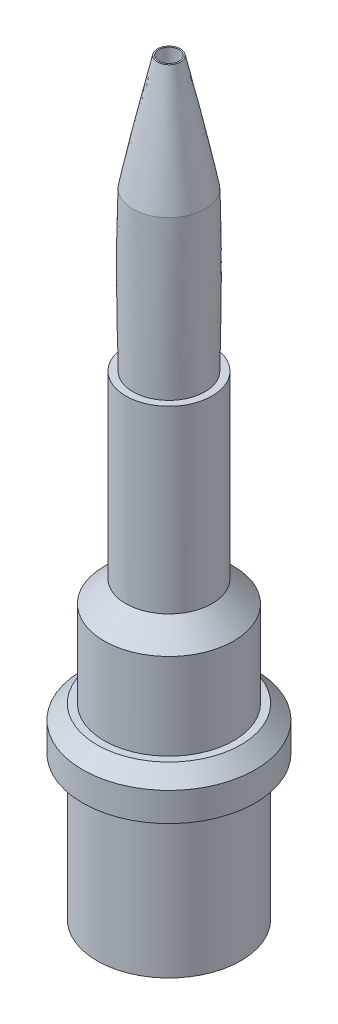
ISO-10303-21;
HEADER;
FILE_DESCRIPTION(('STEP AP214'),'2;1');
FILE_NAME('part.step','',(''),(''),'','','');
FILE_SCHEMA(('AUTOMOTIVE_DESIGN { 1 0 10303 214 1 1 1 1 }'));
ENDSEC;
DATA;
#1=APPLICATION_CONTEXT('core data for automotive mechanical design processes');
#2=APPLICATION_PROTOCOL_DEFINITION('international standard','automotive_design',2000,#1);
#3=PRODUCT_CONTEXT('',#1,'mechanical');
#4=PRODUCT('Part','Part','',(#3));
#5=PRODUCT_RELATED_PRODUCT_CATEGORY('part','',(#4));
#6=PRODUCT_DEFINITION_FORMATION('','',#4);
#7=PRODUCT_DEFINITION_CONTEXT('part definition',#1,'design');
#8=PRODUCT_DEFINITION('design','',#6,#7);
#9=PRODUCT_DEFINITION_SHAPE('','',#8);
#10=(LENGTH_UNIT() NAMED_UNIT(*) SI_UNIT(.MILLI.,.METRE.));
#11=(NAMED_UNIT(*) PLANE_ANGLE_UNIT() SI_UNIT($,.RADIAN.));
#12=(NAMED_UNIT(*) SI_UNIT($,.STERADIAN.) SOLID_ANGLE_UNIT());
#13=UNCERTAINTY_MEASURE_WITH_UNIT(LENGTH_MEASURE(1.E-05),#10,'distance_accuracy_value','');
#14=(GEOMETRIC_REPRESENTATION_CONTEXT(3) GLOBAL_UNCERTAINTY_ASSIGNED_CONTEXT((#13)) GLOBAL_UNIT_ASSIGNED_CONTEXT((#10,
#11,#12)) REPRESENTATION_CONTEXT('',''));
#15=CARTESIAN_POINT('',(0.,0.,0.));
#16=DIRECTION('',(0.,0.,1.));
#17=DIRECTION('',(1.,0.,0.));
#18=AXIS2_PLACEMENT_3D('',#15,#16,#17);
#19=CARTESIAN_POINT('',(0.,26.,0.));
#20=DIRECTION('',(0.,1.,0.));
#21=DIRECTION('',(0.,0.,1.));
#22=AXIS2_PLACEMENT_3D('',#19,#20,#21);
#23=PLANE('',#22);
#24=CARTESIAN_POINT('',(0.,26.,0.));
#25=DIRECTION('',(0.,1.,0.));
#26=DIRECTION('',(0.,0.,1.));
#27=AXIS2_PLACEMENT_3D('',#24,#25,#26);
#28=CIRCLE('',#27,0.35);
#29=CARTESIAN_POINT('',(0.,26.,0.35));
#30=VERTEX_POINT('',#29);
#31=EDGE_CURVE('E199',#30,#30,#28,.T.);
#32=ORIENTED_EDGE('',*,*,#31,.F.);
#33=EDGE_LOOP('',(#32));
#34=FACE_BOUND('',#33,.T.);
#35=CARTESIAN_POINT('',(0.,26.,0.));
#36=DIRECTION('',(0.,1.,0.));
#37=DIRECTION('',(0.,0.,1.));
#38=AXIS2_PLACEMENT_3D('',#35,#36,#37);
#39=CIRCLE('',#38,0.4);
#40=CARTESIAN_POINT('',(0.,26.,0.4));
#41=VERTEX_POINT('',#40);
#42=EDGE_CURVE('E175',#41,#41,#39,.T.);
#43=ORIENTED_EDGE('',*,*,#42,.T.);
#44=EDGE_LOOP('',(#43));
#45=FACE_BOUND('',#44,.T.);
#46=ADVANCED_FACE('F161',(#34,#45),#23,.T.);
#47=CARTESIAN_POINT('',(0.,16.5,0.));
#48=DIRECTION('',(0.,1.,0.));
#49=DIRECTION('',(0.,0.,1.));
#50=AXIS2_PLACEMENT_3D('',#47,#48,#49);
#51=PLANE('',#50);
#52=CARTESIAN_POINT('',(0.,16.5,0.));
#53=DIRECTION('',(0.,1.,0.));
#54=DIRECTION('',(0.,0.,1.));
#55=AXIS2_PLACEMENT_3D('',#52,#53,#54);
#56=CIRCLE('',#55,0.35);
#57=CARTESIAN_POINT('',(0.,16.5,0.35));
#58=VERTEX_POINT('',#57);
#59=EDGE_CURVE('E165',#58,#58,#56,.T.);
#60=ORIENTED_EDGE('',*,*,#59,.T.);
#61=EDGE_LOOP('',(#60));
#62=FACE_BOUND('',#61,.T.);
#63=CARTESIAN_POINT('',(0.,16.5,0.));
#64=DIRECTION('',(0.,1.,0.));
#65=DIRECTION('',(0.,0.,1.));
#66=AXIS2_PLACEMENT_3D('',#63,#64,#65);
#67=CIRCLE('',#66,1.25);
#68=CARTESIAN_POINT('',(0.,16.5,1.25));
#69=VERTEX_POINT('',#68);
#70=EDGE_CURVE('E13',#69,#69,#67,.T.);
#71=ORIENTED_EDGE('',*,*,#70,.F.);
#72=EDGE_LOOP('',(#71));
#73=FACE_BOUND('',#72,.T.);
#74=ADVANCED_FACE('F230',(#62,#73),#51,.F.);
#75=CARTESIAN_POINT('',(-1.25,22.,0.));
#76=CARTESIAN_POINT('',(-0.966666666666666,23.3333333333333,0.));
#77=CARTESIAN_POINT('',(-0.683333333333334,24.6666666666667,0.));
#78=CARTESIAN_POINT('',(-0.4,26.,0.));
#79=CARTESIAN_POINT('',(-1.25,22.,0.163624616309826));
#80=CARTESIAN_POINT('',(-0.966666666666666,23.3333333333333,0.142352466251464));
#81=CARTESIAN_POINT('',(-0.683333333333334,24.6666666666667,0.0973561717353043));
#82=CARTESIAN_POINT('',(-0.4,26.,0.0523598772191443));
#83=CARTESIAN_POINT('',(-1.18498884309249,22.,0.490813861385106));
#84=CARTESIAN_POINT('',(-0.92521149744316,23.3333333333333,0.411903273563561));
#85=CARTESIAN_POINT('',(-0.652206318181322,24.6666666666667,0.284485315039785));
#86=CARTESIAN_POINT('',(-0.379201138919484,26.,0.15706735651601));
#87=CARTESIAN_POINT('',(-0.906916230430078,22.,0.906916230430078));
#88=CARTESIAN_POINT('',(-0.72859268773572,23.3333333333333,0.728603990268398));
#89=CARTESIAN_POINT('',(-0.509386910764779,24.6666666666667,0.509422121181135));
#90=CARTESIAN_POINT('',(-0.290181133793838,26.,0.290240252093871));
#91=CARTESIAN_POINT('',(-0.490813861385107,22.,1.18498884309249));
#92=CARTESIAN_POINT('',(-0.41190567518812,23.3333333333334,0.925207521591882));
#93=CARTESIAN_POINT('',(-0.284492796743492,24.6666666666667,0.652193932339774));
#94=CARTESIAN_POINT('',(-0.157079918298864,26.,0.379180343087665));
#95=CARTESIAN_POINT('',(-0.163624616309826,22.,1.25));
#96=CARTESIAN_POINT('',(-0.142352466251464,23.3333333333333,0.966666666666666));
#97=CARTESIAN_POINT('',(-0.0973561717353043,24.6666666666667,0.683333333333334));
#98=CARTESIAN_POINT('',(-0.0523598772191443,26.,0.4));
#99=CARTESIAN_POINT('',(0.163624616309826,22.,1.25));
#100=CARTESIAN_POINT('',(0.142352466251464,23.3333333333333,0.966666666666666));
#101=CARTESIAN_POINT('',(0.0973561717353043,24.6666666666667,0.683333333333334));
#102=CARTESIAN_POINT('',(0.0523598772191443,26.,0.4));
#103=CARTESIAN_POINT('',(0.490813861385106,22.,1.18498884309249));
#104=CARTESIAN_POINT('',(0.411903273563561,23.3333333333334,0.92521149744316));
#105=CARTESIAN_POINT('',(0.284485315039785,24.6666666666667,0.652206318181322));
#106=CARTESIAN_POINT('',(0.15706735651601,26.,0.379201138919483));
#107=CARTESIAN_POINT('',(0.906916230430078,22.,0.906916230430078));
#108=CARTESIAN_POINT('',(0.728603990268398,23.3333333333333,0.72859268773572));
#109=CARTESIAN_POINT('',(0.509422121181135,24.6666666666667,0.509386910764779));
#110=CARTESIAN_POINT('',(0.290240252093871,26.,0.290181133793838));
#111=CARTESIAN_POINT('',(1.18498884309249,22.,0.490813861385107));
#112=CARTESIAN_POINT('',(0.925207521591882,23.3333333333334,0.41190567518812));
#113=CARTESIAN_POINT('',(0.652193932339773,24.6666666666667,0.284492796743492));
#114=CARTESIAN_POINT('',(0.379180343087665,26.,0.157079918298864));
#115=CARTESIAN_POINT('',(1.25,22.,0.163624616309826));
#116=CARTESIAN_POINT('',(0.966666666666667,23.3333333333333,0.142352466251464));
#117=CARTESIAN_POINT('',(0.683333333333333,24.6666666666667,0.0973561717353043));
#118=CARTESIAN_POINT('',(0.4,26.,0.0523598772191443));
#119=CARTESIAN_POINT('',(1.25,22.,-0.163624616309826));
#120=CARTESIAN_POINT('',(0.966666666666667,23.3333333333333,-0.142352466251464));
#121=CARTESIAN_POINT('',(0.683333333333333,24.6666666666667,-0.0973561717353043));
#122=CARTESIAN_POINT('',(0.4,26.,-0.0523598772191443));
#123=CARTESIAN_POINT('',(1.18498884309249,22.,-0.490813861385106));
#124=CARTESIAN_POINT('',(0.92521149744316,23.3333333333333,-0.411903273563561));
#125=CARTESIAN_POINT('',(0.652206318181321,24.6666666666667,-0.284485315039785));
#126=CARTESIAN_POINT('',(0.379201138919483,26.,-0.15706735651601));
#127=CARTESIAN_POINT('',(0.906916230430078,22.,-0.906916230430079));
#128=CARTESIAN_POINT('',(0.72859268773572,23.3333333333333,-0.728603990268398));
#129=CARTESIAN_POINT('',(0.509386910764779,24.6666666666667,-0.509422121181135));
#130=CARTESIAN_POINT('',(0.290181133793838,26.,-0.290240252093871));
#131=CARTESIAN_POINT('',(0.490813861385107,22.,-1.18498884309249));
#132=CARTESIAN_POINT('',(0.41190567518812,23.3333333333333,-0.925207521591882));
#133=CARTESIAN_POINT('',(0.284492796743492,24.6666666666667,-0.652193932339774));
#134=CARTESIAN_POINT('',(0.157079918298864,26.,-0.379180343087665));
#135=CARTESIAN_POINT('',(0.163624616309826,22.,-1.25));
#136=CARTESIAN_POINT('',(0.142352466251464,23.3333333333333,-0.966666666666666));
#137=CARTESIAN_POINT('',(0.0973561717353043,24.6666666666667,-0.683333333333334));
#138=CARTESIAN_POINT('',(0.0523598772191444,26.,-0.4));
#139=CARTESIAN_POINT('',(-0.163624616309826,22.,-1.25));
#140=CARTESIAN_POINT('',(-0.142352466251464,23.3333333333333,-0.966666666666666));
#141=CARTESIAN_POINT('',(-0.0973561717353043,24.6666666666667,-0.683333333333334));
#142=CARTESIAN_POINT('',(-0.0523598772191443,26.,-0.4));
#143=CARTESIAN_POINT('',(-0.490813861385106,22.,-1.18498884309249));
#144=CARTESIAN_POINT('',(-0.411903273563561,23.3333333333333,-0.92521149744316));
#145=CARTESIAN_POINT('',(-0.284485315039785,24.6666666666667,-0.652206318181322));
#146=CARTESIAN_POINT('',(-0.15706735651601,26.,-0.379201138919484));
#147=CARTESIAN_POINT('',(-0.906916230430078,22.,-0.906916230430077));
#148=CARTESIAN_POINT('',(-0.728603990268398,23.3333333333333,-0.728592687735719));
#149=CARTESIAN_POINT('',(-0.509422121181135,24.6666666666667,-0.509386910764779));
#150=CARTESIAN_POINT('',(-0.290240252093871,26.,-0.290181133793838));
#151=CARTESIAN_POINT('',(-1.18498884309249,22.,-0.490813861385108));
#152=CARTESIAN_POINT('',(-0.925207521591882,23.3333333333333,-0.411905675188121));
#153=CARTESIAN_POINT('',(-0.652193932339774,24.6666666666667,-0.284492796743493));
#154=CARTESIAN_POINT('',(-0.379180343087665,26.,-0.157079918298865));
#155=CARTESIAN_POINT('',(-1.25,22.,-0.163624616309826));
#156=CARTESIAN_POINT('',(-0.966666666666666,23.3333333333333,-0.142352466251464));
#157=CARTESIAN_POINT('',(-0.683333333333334,24.6666666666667,-0.0973561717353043));
#158=CARTESIAN_POINT('',(-0.4,26.,-0.0523598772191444));
#159=CARTESIAN_POINT('',(-1.25,22.,0.));
#160=CARTESIAN_POINT('',(-0.966666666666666,23.3333333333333,0.));
#161=CARTESIAN_POINT('',(-0.683333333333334,24.6666666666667,0.));
#162=CARTESIAN_POINT('',(-0.4,26.,0.));
#163=B_SPLINE_SURFACE_WITH_KNOTS('',3,3,((#75,#76,#77,#78),(#79,#80,#81,#82),(#83,#84,#85,#86),
(#87,#88,#89,#90),(#91,#92,#93,#94),(#95,#96,#97,#98),(#99,#100,#101,#102),(#103,#104,#105,
#106),(#107,#108,#109,#110),(#111,#112,#113,#114),(#115,#116,#117,#118),(#119,#120,#121,#122),
(#123,#124,#125,#126),(#127,#128,#129,#130),(#131,#132,#133,#134),(#135,#136,#137,#138),(#139,
#140,#141,#142),(#143,#144,#145,#146),(#147,#148,#149,#150),(#151,#152,#153,#154),(#155,#156,
#157,#158),(#159,#160,#161,#162)),.UNSPECIFIED.,.T.,.F.,.F.,(4,1,1,1,2,1,1,1,2,1,1,1,2,1,1,1,4),
(4,4),(0.,0.0625,0.125,0.1875,0.25,0.3125,0.375,0.4375,0.5,0.5625,0.625,0.6875,0.75,0.8125,
0.875,0.9375,1.),(0.57355502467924,1.),.UNSPECIFIED.);
#164=CARTESIAN_POINT('',(-1.25,22.,0.));
#165=CARTESIAN_POINT('',(-1.25,22.,0.163624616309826));
#166=CARTESIAN_POINT('',(-1.18498884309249,22.,0.490813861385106));
#167=CARTESIAN_POINT('',(-0.906916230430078,22.,0.906916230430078));
#168=CARTESIAN_POINT('',(-0.490813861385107,22.,1.18498884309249));
#169=CARTESIAN_POINT('',(-0.163624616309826,22.,1.25));
#170=CARTESIAN_POINT('',(0.163624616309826,22.,1.25));
#171=CARTESIAN_POINT('',(0.490813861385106,22.,1.18498884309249));
#172=CARTESIAN_POINT('',(0.906916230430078,22.,0.906916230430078));
#173=CARTESIAN_POINT('',(1.18498884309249,22.,0.490813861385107));
#174=CARTESIAN_POINT('',(1.25,22.,0.163624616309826));
#175=CARTESIAN_POINT('',(1.25,22.,-0.163624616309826));
#176=CARTESIAN_POINT('',(1.18498884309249,22.,-0.490813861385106));
#177=CARTESIAN_POINT('',(0.906916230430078,22.,-0.906916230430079));
#178=CARTESIAN_POINT('',(0.490813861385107,22.,-1.18498884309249));
#179=CARTESIAN_POINT('',(0.163624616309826,22.,-1.25));
#180=CARTESIAN_POINT('',(-0.163624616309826,22.,-1.25));
#181=CARTESIAN_POINT('',(-0.490813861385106,22.,-1.18498884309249));
#182=CARTESIAN_POINT('',(-0.906916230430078,22.,-0.906916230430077));
#183=CARTESIAN_POINT('',(-1.18498884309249,22.,-0.490813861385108));
#184=CARTESIAN_POINT('',(-1.25,22.,-0.163624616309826));
#185=CARTESIAN_POINT('',(-1.25,22.,0.));
#186=B_SPLINE_CURVE_WITH_KNOTS('',3,(#164,#165,#166,#167,#168,#169,#170,#171,#172,#173,#174,
#175,#176,#177,#178,#179,#180,#181,#182,#183,#184,#185),.UNSPECIFIED.,.T.,.F.,(4,1,1,1,2,1,1,1,
2,1,1,1,2,1,1,1,4),(0.,0.0625,0.125,0.1875,0.25,0.3125,0.375,0.4375,0.5,0.5625,0.625,0.6875,
0.75,0.8125,0.875,0.9375,1.),.UNSPECIFIED.);
#187=CARTESIAN_POINT('',(-1.25,22.,0.));
#188=VERTEX_POINT('',#187);
#189=EDGE_CURVE('E169',#188,#188,#186,.T.);
#190=ORIENTED_EDGE('',*,*,#42,.F.);
#191=EDGE_LOOP('',(#190));
#192=FACE_BOUND('',#191,.T.);
#193=ORIENTED_EDGE('',*,*,#189,.T.);
#194=EDGE_LOOP('',(#193));
#195=FACE_BOUND('',#194,.T.);
#196=ADVANCED_FACE('F228',(#192,#195),#163,.T.);
#197=CARTESIAN_POINT('',(-1.25,16.5,0.));
#198=CARTESIAN_POINT('',(-1.25,18.3333333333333,0.));
#199=CARTESIAN_POINT('',(-1.25,20.1666666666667,0.));
#200=CARTESIAN_POINT('',(-1.25,22.,0.));
#201=CARTESIAN_POINT('',(-1.25,16.5,0.163624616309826));
#202=CARTESIAN_POINT('',(-1.25,18.3333333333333,0.177929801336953));
#203=CARTESIAN_POINT('',(-1.25,20.1666666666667,0.19223498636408));
#204=CARTESIAN_POINT('',(-1.25,22.,0.163624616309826));
#205=CARTESIAN_POINT('',(-1.18498884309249,16.5,0.490813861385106));
#206=CARTESIAN_POINT('',(-1.19296496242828,18.3333333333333,0.520062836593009));
#207=CARTESIAN_POINT('',(-1.20094108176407,20.1666666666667,0.549311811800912));
#208=CARTESIAN_POINT('',(-1.18498884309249,22.,0.490813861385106));
#209=CARTESIAN_POINT('',(-0.906916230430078,16.5,0.906916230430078));
#210=CARTESIAN_POINT('',(-0.931567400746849,18.3333333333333,0.93155979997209));
#211=CARTESIAN_POINT('',(-0.95621857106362,20.1666666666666,0.956203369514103));
#212=CARTESIAN_POINT('',(-0.906916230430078,22.,0.906916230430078));
#213=CARTESIAN_POINT('',(-0.490813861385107,16.5,1.18498884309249));
#214=CARTESIAN_POINT('',(-0.520061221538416,18.3333333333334,1.19296763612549));
#215=CARTESIAN_POINT('',(-0.549308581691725,20.1666666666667,1.20094642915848));
#216=CARTESIAN_POINT('',(-0.490813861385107,22.,1.18498884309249));
#217=CARTESIAN_POINT('',(-0.163624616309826,16.5,1.25));
#218=CARTESIAN_POINT('',(-0.177929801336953,18.3333333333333,1.25));
#219=CARTESIAN_POINT('',(-0.19223498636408,20.1666666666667,1.25));
#220=CARTESIAN_POINT('',(-0.163624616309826,22.,1.25));
#221=CARTESIAN_POINT('',(0.163624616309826,16.5,1.25));
#222=CARTESIAN_POINT('',(0.177929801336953,18.3333333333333,1.25));
#223=CARTESIAN_POINT('',(0.19223498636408,20.1666666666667,1.25));
#224=CARTESIAN_POINT('',(0.163624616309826,22.,1.25));
#225=CARTESIAN_POINT('',(0.490813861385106,16.5,1.18498884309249));
#226=CARTESIAN_POINT('',(0.520062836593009,18.3333333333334,1.19296496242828));
#227=CARTESIAN_POINT('',(0.549311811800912,20.1666666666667,1.20094108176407));
#228=CARTESIAN_POINT('',(0.490813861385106,22.,1.18498884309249));
#229=CARTESIAN_POINT('',(0.906916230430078,16.5,0.906916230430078));
#230=CARTESIAN_POINT('',(0.93155979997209,18.3333333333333,0.931567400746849));
#231=CARTESIAN_POINT('',(0.956203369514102,20.1666666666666,0.95621857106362));
#232=CARTESIAN_POINT('',(0.906916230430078,22.,0.906916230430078));
#233=CARTESIAN_POINT('',(1.18498884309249,16.5,0.490813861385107));
#234=CARTESIAN_POINT('',(1.19296763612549,18.3333333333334,0.520061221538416));
#235=CARTESIAN_POINT('',(1.20094642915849,20.1666666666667,0.549308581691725));
#236=CARTESIAN_POINT('',(1.18498884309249,22.,0.490813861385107));
#237=CARTESIAN_POINT('',(1.25,16.5,0.163624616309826));
#238=CARTESIAN_POINT('',(1.25,18.3333333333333,0.177929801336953));
#239=CARTESIAN_POINT('',(1.25,20.1666666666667,0.19223498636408));
#240=CARTESIAN_POINT('',(1.25,22.,0.163624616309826));
#241=CARTESIAN_POINT('',(1.25,16.5,-0.163624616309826));
#242=CARTESIAN_POINT('',(1.25,18.3333333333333,-0.177929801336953));
#243=CARTESIAN_POINT('',(1.25,20.1666666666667,-0.19223498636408));
#244=CARTESIAN_POINT('',(1.25,22.,-0.163624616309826));
#245=CARTESIAN_POINT('',(1.18498884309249,16.5,-0.490813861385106));
#246=CARTESIAN_POINT('',(1.19296496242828,18.3333333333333,-0.520062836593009));
#247=CARTESIAN_POINT('',(1.20094108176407,20.1666666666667,-0.549311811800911));
#248=CARTESIAN_POINT('',(1.18498884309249,22.,-0.490813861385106));
#249=CARTESIAN_POINT('',(0.906916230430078,16.5,-0.906916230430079));
#250=CARTESIAN_POINT('',(0.93156740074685,18.3333333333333,-0.931559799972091));
#251=CARTESIAN_POINT('',(0.956218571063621,20.1666666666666,-0.956203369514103));
#252=CARTESIAN_POINT('',(0.906916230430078,22.,-0.906916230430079));
#253=CARTESIAN_POINT('',(0.490813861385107,16.5,-1.18498884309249));
#254=CARTESIAN_POINT('',(0.520061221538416,18.3333333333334,-1.19296763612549));
#255=CARTESIAN_POINT('',(0.549308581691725,20.1666666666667,-1.20094642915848));
#256=CARTESIAN_POINT('',(0.490813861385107,22.,-1.18498884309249));
#257=CARTESIAN_POINT('',(0.163624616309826,16.5,-1.25));
#258=CARTESIAN_POINT('',(0.177929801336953,18.3333333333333,-1.25));
#259=CARTESIAN_POINT('',(0.19223498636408,20.1666666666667,-1.25));
#260=CARTESIAN_POINT('',(0.163624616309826,22.,-1.25));
#261=CARTESIAN_POINT('',(-0.163624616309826,16.5,-1.25));
#262=CARTESIAN_POINT('',(-0.177929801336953,18.3333333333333,-1.25));
#263=CARTESIAN_POINT('',(-0.19223498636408,20.1666666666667,-1.25));
#264=CARTESIAN_POINT('',(-0.163624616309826,22.,-1.25));
#265=CARTESIAN_POINT('',(-0.490813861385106,16.5,-1.18498884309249));
#266=CARTESIAN_POINT('',(-0.520062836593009,18.3333333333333,-1.19296496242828));
#267=CARTESIAN_POINT('',(-0.549311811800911,20.1666666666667,-1.20094108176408));
#268=CARTESIAN_POINT('',(-0.490813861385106,22.,-1.18498884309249));
#269=CARTESIAN_POINT('',(-0.906916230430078,16.5,-0.906916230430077));
#270=CARTESIAN_POINT('',(-0.93155979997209,18.3333333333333,-0.931567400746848));
#271=CARTESIAN_POINT('',(-0.956203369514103,20.1666666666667,-0.956218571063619));
#272=CARTESIAN_POINT('',(-0.906916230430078,22.,-0.906916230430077));
#273=CARTESIAN_POINT('',(-1.18498884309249,16.5,-0.490813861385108));
#274=CARTESIAN_POINT('',(-1.19296763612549,18.3333333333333,-0.520061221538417));
#275=CARTESIAN_POINT('',(-1.20094642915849,20.1666666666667,-0.549308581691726));
#276=CARTESIAN_POINT('',(-1.18498884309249,22.,-0.490813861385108));
#277=CARTESIAN_POINT('',(-1.25,16.5,-0.163624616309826));
#278=CARTESIAN_POINT('',(-1.25,18.3333333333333,-0.177929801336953));
#279=CARTESIAN_POINT('',(-1.25,20.1666666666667,-0.19223498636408));
#280=CARTESIAN_POINT('',(-1.25,22.,-0.163624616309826));
#281=CARTESIAN_POINT('',(-1.25,16.5,0.));
#282=CARTESIAN_POINT('',(-1.25,18.3333333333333,0.));
#283=CARTESIAN_POINT('',(-1.25,20.1666666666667,0.));
#284=CARTESIAN_POINT('',(-1.25,22.,0.));
#285=B_SPLINE_SURFACE_WITH_KNOTS('',3,3,((#197,#198,#199,#200),(#201,#202,#203,#204),(#205,#206,
#207,#208),(#209,#210,#211,#212),(#213,#214,#215,#216),(#217,#218,#219,#220),(#221,#222,#223,
#224),(#225,#226,#227,#228),(#229,#230,#231,#232),(#233,#234,#235,#236),(#237,#238,#239,#240),
(#241,#242,#243,#244),(#245,#246,#247,#248),(#249,#250,#251,#252),(#253,#254,#255,#256),(#257,
#258,#259,#260),(#261,#262,#263,#264),(#265,#266,#267,#268),(#269,#270,#271,#272),(#273,#274,
#275,#276),(#277,#278,#279,#280),(#281,#282,#283,#284)),.UNSPECIFIED.,.T.,.F.,.F.,(4,1,1,1,2,1,
1,1,2,1,1,1,2,1,1,1,4),(4,4),(0.,0.0625,0.125,0.1875,0.25,0.3125,0.375,0.4375,0.5,0.5625,0.625,
0.6875,0.75,0.8125,0.875,0.9375,1.),(0.,0.57355502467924),.UNSPECIFIED.);
#286=ORIENTED_EDGE('',*,*,#189,.F.);
#287=EDGE_LOOP('',(#286));
#288=FACE_BOUND('',#287,.T.);
#289=ORIENTED_EDGE('',*,*,#70,.T.);
#290=EDGE_LOOP('',(#289));
#291=FACE_BOUND('',#290,.T.);
#292=ADVANCED_FACE('F217',(#288,#291),#285,.T.);
#293=CARTESIAN_POINT('',(0.,0.,0.));
#294=DIRECTION('',(0.,1.,0.));
#295=DIRECTION('',(0.,0.,1.));
#296=AXIS2_PLACEMENT_3D('',#293,#294,#295);
#297=CYLINDRICAL_SURFACE('',#296,0.35);
#298=ORIENTED_EDGE('',*,*,#31,.T.);
#299=EDGE_LOOP('',(#298));
#300=FACE_BOUND('',#299,.T.);
#301=ORIENTED_EDGE('',*,*,#59,.F.);
#302=EDGE_LOOP('',(#301));
#303=FACE_BOUND('',#302,.T.);
#304=ADVANCED_FACE('F227',(#300,#303),#297,.F.);
#305=CLOSED_SHELL('',(#46,#74,#196,#292,#304));
#306=MANIFOLD_SOLID_BREP('B2',#305);
#307=CARTESIAN_POINT('',(0.,6.5,0.));
#308=DIRECTION('',(0.,1.,0.));
#309=DIRECTION('',(0.,0.,1.));
#310=AXIS2_PLACEMENT_3D('',#307,#308,#309);
#311=PLANE('',#310);
#312=CARTESIAN_POINT('',(0.,6.5,0.));
#313=DIRECTION('',(0.,1.,0.));
#314=DIRECTION('',(0.,0.,1.));
#315=AXIS2_PLACEMENT_3D('',#312,#313,#314);
#316=CIRCLE('',#315,2.5);
#317=CARTESIAN_POINT('',(0.,6.5,2.5));
#318=VERTEX_POINT('',#317);
#319=EDGE_CURVE('E308',#318,#318,#316,.T.);
#320=ORIENTED_EDGE('',*,*,#319,.T.);
#321=EDGE_LOOP('',(#320));
#322=FACE_BOUND('',#321,.T.);
#323=CARTESIAN_POINT('',(0.,6.5,0.));
#324=DIRECTION('',(0.,1.,0.));
#325=DIRECTION('',(0.,0.,1.));
#326=AXIS2_PLACEMENT_3D('',#323,#324,#325);
#327=CIRCLE('',#326,2.25);
#328=CARTESIAN_POINT('',(0.,6.5,2.25));
#329=VERTEX_POINT('',#328);
#330=EDGE_CURVE('E335',#329,#329,#327,.T.);
#331=ORIENTED_EDGE('',*,*,#330,.F.);
#332=EDGE_LOOP('',(#331));
#333=FACE_BOUND('',#332,.T.);
#334=ADVANCED_FACE('F301',(#322,#333),#311,.T.);
#335=CARTESIAN_POINT('',(0.,5.,0.));
#336=DIRECTION('',(0.,-1.,0.));
#337=DIRECTION('',(0.,0.,-1.));
#338=AXIS2_PLACEMENT_3D('',#335,#336,#337);
#339=CYLINDRICAL_SURFACE('',#338,2.5);
#340=CARTESIAN_POINT('',(0.,5.,0.));
#341=DIRECTION('',(0.,1.,0.));
#342=DIRECTION('',(0.,0.,1.));
#343=AXIS2_PLACEMENT_3D('',#340,#341,#342);
#344=CIRCLE('',#343,2.5);
#345=CARTESIAN_POINT('',(0.,5.,2.5));
#346=VERTEX_POINT('',#345);
#347=EDGE_CURVE('E321',#346,#346,#344,.T.);
#348=ORIENTED_EDGE('',*,*,#347,.F.);
#349=EDGE_LOOP('',(#348));
#350=FACE_BOUND('',#349,.T.);
#351=CARTESIAN_POINT('',(0.,0.,0.));
#352=DIRECTION('',(0.,1.,0.));
#353=DIRECTION('',(0.,0.,1.));
#354=AXIS2_PLACEMENT_3D('',#351,#352,#353);
#355=CIRCLE('',#354,2.5);
#356=CARTESIAN_POINT('',(0.,0.,2.5));
#357=VERTEX_POINT('',#356);
#358=EDGE_CURVE('E327',#357,#357,#355,.T.);
#359=ORIENTED_EDGE('',*,*,#358,.T.);
#360=EDGE_LOOP('',(#359));
#361=FACE_BOUND('',#360,.T.);
#362=ADVANCED_FACE('F361',(#350,#361),#339,.T.);
#363=CARTESIAN_POINT('',(0.,0.,0.));
#364=DIRECTION('',(0.,1.,0.));
#365=DIRECTION('',(0.,0.,1.));
#366=AXIS2_PLACEMENT_3D('',#363,#364,#365);
#367=PLANE('',#366);
#368=CARTESIAN_POINT('',(0.,0.,0.));
#369=DIRECTION('',(0.,1.,0.));
#370=DIRECTION('',(0.,0.,1.));
#371=AXIS2_PLACEMENT_3D('',#368,#369,#370);
#372=CIRCLE('',#371,0.35);
#373=CARTESIAN_POINT('',(0.,0.,0.35));
#374=VERTEX_POINT('',#373);
#375=EDGE_CURVE('E326',#374,#374,#372,.T.);
#376=ORIENTED_EDGE('',*,*,#375,.T.);
#377=EDGE_LOOP('',(#376));
#378=FACE_BOUND('',#377,.T.);
#379=ORIENTED_EDGE('',*,*,#358,.F.);
#380=EDGE_LOOP('',(#379));
#381=FACE_BOUND('',#380,.T.);
#382=ADVANCED_FACE('F343',(#378,#381),#367,.F.);
#383=CARTESIAN_POINT('',(0.,5.,0.));
#384=DIRECTION('',(0.,1.,0.));
#385=DIRECTION('',(0.,0.,1.));
#386=AXIS2_PLACEMENT_3D('',#383,#384,#385);
#387=PLANE('',#386);
#388=CARTESIAN_POINT('',(0.,5.,0.));
#389=DIRECTION('',(0.,1.,0.));
#390=DIRECTION('',(0.,0.,1.));
#391=AXIS2_PLACEMENT_3D('',#388,#389,#390);
#392=CIRCLE('',#391,3.);
#393=CARTESIAN_POINT('',(0.,5.,3.));
#394=VERTEX_POINT('',#393);
#395=EDGE_CURVE('E330',#394,#394,#392,.T.);
#396=ORIENTED_EDGE('',*,*,#395,.F.);
#397=EDGE_LOOP('',(#396));
#398=FACE_BOUND('',#397,.T.);
#399=ORIENTED_EDGE('',*,*,#347,.T.);
#400=EDGE_LOOP('',(#399));
#401=FACE_BOUND('',#400,.T.);
#402=ADVANCED_FACE('F373',(#398,#401),#387,.F.);
#403=CARTESIAN_POINT('',(0.,6.5,0.));
#404=DIRECTION('',(0.,-1.,0.));
#405=DIRECTION('',(0.,0.,-1.));
#406=AXIS2_PLACEMENT_3D('',#403,#404,#405);
#407=CYLINDRICAL_SURFACE('',#406,3.);
#408=CARTESIAN_POINT('',(0.,5.99999999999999,0.));
#409=DIRECTION('',(0.,1.,0.));
#410=DIRECTION('',(0.,0.,1.));
#411=AXIS2_PLACEMENT_3D('',#408,#409,#410);
#412=CIRCLE('',#411,3.);
#413=CARTESIAN_POINT('',(0.,5.99999999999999,3.));
#414=VERTEX_POINT('',#413);
#415=EDGE_CURVE('E160',#414,#414,#412,.F.);
#416=ORIENTED_EDGE('',*,*,#415,.T.);
#417=EDGE_LOOP('',(#416));
#418=FACE_BOUND('',#417,.T.);
#419=ORIENTED_EDGE('',*,*,#395,.T.);
#420=EDGE_LOOP('',(#419));
#421=FACE_BOUND('',#420,.T.);
#422=ADVANCED_FACE('F376',(#418,#421),#407,.T.);
#423=CARTESIAN_POINT('',(0.,10.5,0.));
#424=DIRECTION('',(0.,-1.,0.));
#425=DIRECTION('',(0.,0.,-1.));
#426=AXIS2_PLACEMENT_3D('',#423,#424,#425);
#427=CYLINDRICAL_SURFACE('',#426,2.25);
#428=CARTESIAN_POINT('',(0.,9.49999999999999,0.));
#429=DIRECTION('',(0.,1.,0.));
#430=DIRECTION('',(0.,0.,1.));
#431=AXIS2_PLACEMENT_3D('',#428,#429,#430);
#432=CIRCLE('',#431,2.25);
#433=CARTESIAN_POINT('',(0.,9.49999999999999,2.25));
#434=VERTEX_POINT('',#433);
#435=EDGE_CURVE('E316',#434,#434,#432,.F.);
#436=ORIENTED_EDGE('',*,*,#435,.T.);
#437=EDGE_LOOP('',(#436));
#438=FACE_BOUND('',#437,.T.);
#439=ORIENTED_EDGE('',*,*,#330,.T.);
#440=EDGE_LOOP('',(#439));
#441=FACE_BOUND('',#440,.T.);
#442=ADVANCED_FACE('F371',(#438,#441),#427,.T.);
#443=CARTESIAN_POINT('',(0.,16.5,0.));
#444=DIRECTION('',(0.,-1.,0.));
#445=DIRECTION('',(0.,0.,-1.));
#446=AXIS2_PLACEMENT_3D('',#443,#444,#445);
#447=CYLINDRICAL_SURFACE('',#446,1.5);
#448=CARTESIAN_POINT('',(0.,10.25,0.));
#449=DIRECTION('',(0.,-1.,0.));
#450=DIRECTION('',(0.,0.,-1.));
#451=AXIS2_PLACEMENT_3D('',#448,#449,#450);
#452=CIRCLE('',#451,1.5);
#453=CARTESIAN_POINT('',(0.,10.25,-1.5));
#454=VERTEX_POINT('',#453);
#455=EDGE_CURVE('E312',#454,#454,#452,.F.);
#456=ORIENTED_EDGE('',*,*,#455,.T.);
#457=EDGE_LOOP('',(#456));
#458=FACE_BOUND('',#457,.T.);
#459=CARTESIAN_POINT('',(0.,16.5,0.));
#460=DIRECTION('',(0.,1.,0.));
#461=DIRECTION('',(0.,0.,1.));
#462=AXIS2_PLACEMENT_3D('',#459,#460,#461);
#463=CIRCLE('',#462,1.5);
#464=CARTESIAN_POINT('',(0.,16.5,1.5));
#465=VERTEX_POINT('',#464);
#466=EDGE_CURVE('E325',#465,#465,#463,.T.);
#467=ORIENTED_EDGE('',*,*,#466,.F.);
#468=EDGE_LOOP('',(#467));
#469=FACE_BOUND('',#468,.T.);
#470=ADVANCED_FACE('F357',(#458,#469),#447,.T.);
#471=CARTESIAN_POINT('',(0.,16.5,0.));
#472=DIRECTION('',(0.,1.,0.));
#473=DIRECTION('',(0.,0.,1.));
#474=AXIS2_PLACEMENT_3D('',#471,#472,#473);
#475=PLANE('',#474);
#476=CARTESIAN_POINT('',(0.,16.5,0.));
#477=DIRECTION('',(0.,1.,0.));
#478=DIRECTION('',(0.,0.,1.));
#479=AXIS2_PLACEMENT_3D('',#476,#477,#478);
#480=CIRCLE('',#479,0.35);
#481=CARTESIAN_POINT('',(0.,16.5,0.35));
#482=VERTEX_POINT('',#481);
#483=EDGE_CURVE('E322',#482,#482,#480,.T.);
#484=ORIENTED_EDGE('',*,*,#483,.F.);
#485=EDGE_LOOP('',(#484));
#486=FACE_BOUND('',#485,.T.);
#487=ORIENTED_EDGE('',*,*,#466,.T.);
#488=EDGE_LOOP('',(#487));
#489=FACE_BOUND('',#488,.T.);
#490=ADVANCED_FACE('F349',(#486,#489),#475,.T.);
#491=CARTESIAN_POINT('',(0.,0.,0.));
#492=DIRECTION('',(0.,1.,0.));
#493=DIRECTION('',(0.,0.,1.));
#494=AXIS2_PLACEMENT_3D('',#491,#492,#493);
#495=CYLINDRICAL_SURFACE('',#494,0.35);
#496=ORIENTED_EDGE('',*,*,#483,.T.);
#497=EDGE_LOOP('',(#496));
#498=FACE_BOUND('',#497,.T.);
#499=ORIENTED_EDGE('',*,*,#375,.F.);
#500=EDGE_LOOP('',(#499));
#501=FACE_BOUND('',#500,.T.);
#502=ADVANCED_FACE('F346',(#498,#501),#495,.F.);
#503=CARTESIAN_POINT('',(0.,10.5,0.));
#504=DIRECTION('',(0.,-1.,0.));
#505=DIRECTION('',(0.,0.,-1.));
#506=AXIS2_PLACEMENT_3D('',#503,#504,#505);
#507=CONICAL_SURFACE('',#506,1.24999999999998,0.785398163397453);
#508=ORIENTED_EDGE('',*,*,#435,.F.);
#509=EDGE_LOOP('',(#508));
#510=FACE_BOUND('',#509,.T.);
#511=ORIENTED_EDGE('',*,*,#455,.F.);
#512=EDGE_LOOP('',(#511));
#513=FACE_BOUND('',#512,.T.);
#514=ADVANCED_FACE('F348',(#510,#513),#507,.T.);
#515=CARTESIAN_POINT('',(0.,6.5,0.));
#516=DIRECTION('',(0.,-1.,0.));
#517=DIRECTION('',(0.,0.,-1.));
#518=AXIS2_PLACEMENT_3D('',#515,#516,#517);
#519=CONICAL_SURFACE('',#518,2.5,0.785398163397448);
#520=ORIENTED_EDGE('',*,*,#415,.F.);
#521=EDGE_LOOP('',(#520));
#522=FACE_BOUND('',#521,.T.);
#523=ORIENTED_EDGE('',*,*,#319,.F.);
#524=EDGE_LOOP('',(#523));
#525=FACE_BOUND('',#524,.T.);
#526=ADVANCED_FACE('F303',(#522,#525),#519,.T.);
#527=CLOSED_SHELL('',(#334,#362,#382,#402,#422,#442,#470,#490,#502,#514,#526));
#528=MANIFOLD_SOLID_BREP('B8',#527);
#529=ADVANCED_BREP_SHAPE_REPRESENTATION('',(#18,#306,#528),#14);
#530=SHAPE_DEFINITION_REPRESENTATION(#9,#529);
ENDSEC;
END-ISO-10303-21;
